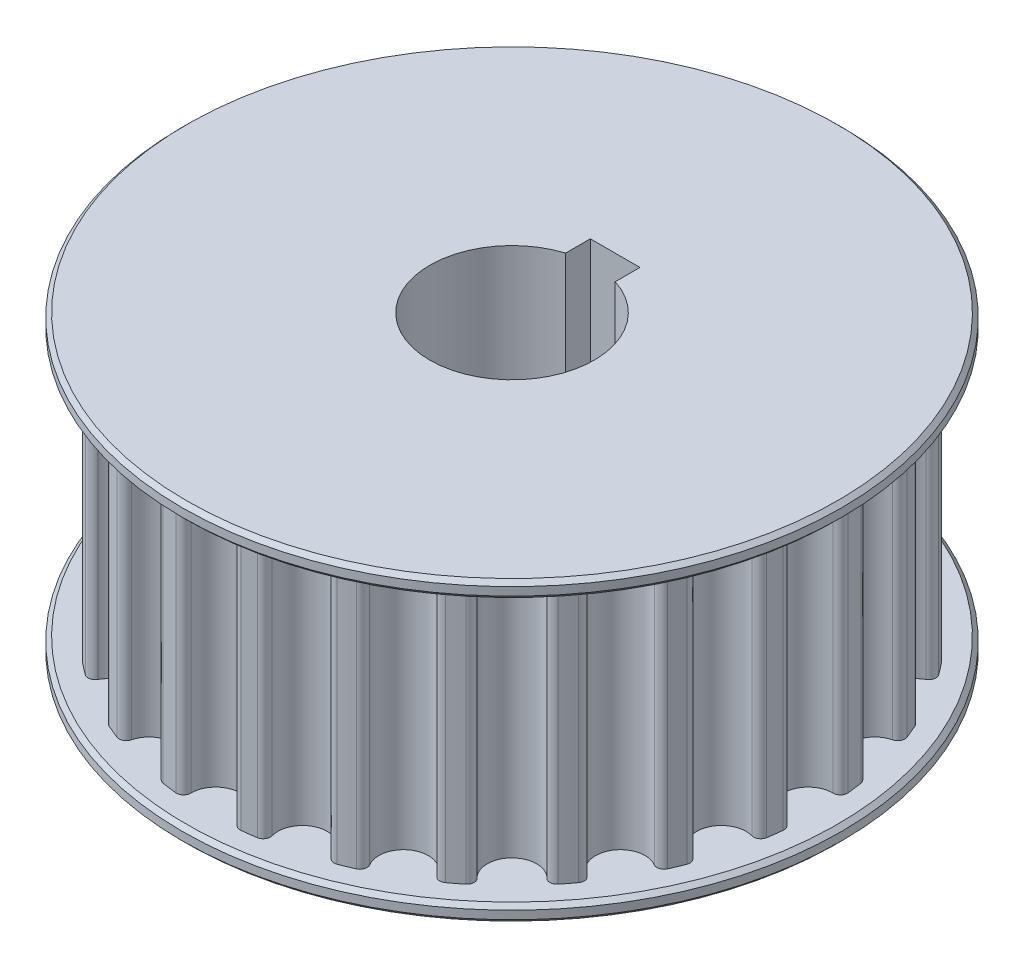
from build123d import *

# Parameters (mm, degrees)
BOSS_EXTRUDE1_DEPTH      = 8
BOSS_EXTRUDE2_START      = 1
SKETCH2_R                = 20
BOSS_EXTRUDE2_DEPTH      = 1
CHAMFER1_SIZE            = 0.25
CHAMFER1_OF_MIRROR1_SIZE = 0.25
SKETCH3_R                = 1.2
CUT_EXTRUDE1_DEPTH       = 30.681644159


with BuildPart() as part:
    # Sketch1 → Boss-Extrude1 (new, symmetric)
    with BuildSketch(Plane(origin=(0, 0, 0), x_dir=(1, 0, 0), z_dir=(0, 1, 0))):
        with BuildLine():
            ThreePointArc((17.76116739, -3.206325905), (18.11028764, -3.154561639), (18.3030647, -2.858924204))
            ThreePointArc((18.3030647, -2.858924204), (18.366516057, -2.417997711), (18.419346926, -1.975673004))
            ThreePointArc((18.419346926, -1.975673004), (18.309655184, -1.640214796), (17.985828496, -1.499855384))
            ThreePointArc((17.985828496, -1.499855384), (16.465, 0), (17.985828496, 1.499855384))
            ThreePointArc((17.985828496, 1.499855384), (18.309655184, 1.640214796), (18.419346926, 1.975673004))
            ThreePointArc((18.419346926, 1.975673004), (18.366516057, 2.417997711), (18.3030647, 2.858924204))
            ThreePointArc((18.3030647, 2.858924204), (18.11028764, 3.154561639), (17.76116739, 3.206325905))
            ThreePointArc((17.76116739, 3.206325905), (15.90396873, 4.261455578), (16.984785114, 6.103824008))
            ThreePointArc((16.984785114, 6.103824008), (17.261249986, 6.323213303), (17.280381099, 6.675631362))
            ThreePointArc((17.280381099, 6.675631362), (17.11486834, 7.089210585), (16.939458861, 7.498690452))
            ThreePointArc((16.939458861, 7.498690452), (16.676733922, 7.734359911), (16.326112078, 7.694001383))
            ThreePointArc((16.326112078, 7.694001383), (14.259108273, 8.2325), (14.826256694, 10.291827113))
            ThreePointArc((14.826256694, 10.291827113), (15.036519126, 10.575295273), (14.963785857, 10.920656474))
            ThreePointArc((14.963785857, 10.920656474), (14.696870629, 11.277305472), (14.421456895, 11.627433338))
            ThreePointArc((14.421456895, 11.627433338), (14.106688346, 11.787074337), (13.778459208, 11.657343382))
            ThreePointArc((13.778459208, 11.657343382), (11.642513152, 11.642513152), (11.657343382, 13.778459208))
            ThreePointArc((11.657343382, 13.778459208), (11.787074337, 14.106688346), (11.627433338, 14.421456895))
            ThreePointArc((11.627433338, 14.421456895), (11.277305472, 14.696870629), (10.920656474, 14.963785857))
            ThreePointArc((10.920656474, 14.963785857), (10.575295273, 15.036519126), (10.291827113, 14.826256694))
            ThreePointArc((10.291827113, 14.826256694), (8.2325, 14.259108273), (7.694001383, 16.326112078))
            ThreePointArc((7.694001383, 16.326112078), (7.734359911, 16.676733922), (7.498690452, 16.939458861))
            ThreePointArc((7.498690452, 16.939458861), (7.089210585, 17.11486834), (6.675631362, 17.280381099))
            ThreePointArc((6.675631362, 17.280381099), (6.323213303, 17.261249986), (6.103824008, 16.984785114))
            ThreePointArc((6.103824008, 16.984785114), (4.261455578, 15.90396873), (3.206325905, 17.76116739))
            ThreePointArc((3.206325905, 17.76116739), (3.154561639, 18.11028764), (2.858924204, 18.3030647))
            ThreePointArc((2.858924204, 18.3030647), (2.417997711, 18.366516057), (1.975673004, 18.419346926))
            ThreePointArc((1.975673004, 18.419346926), (1.640214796, 18.309655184), (1.499855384, 17.985828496))
            ThreePointArc((1.499855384, 17.985828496), (0, 16.465), (-1.499855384, 17.985828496))
            ThreePointArc((-1.499855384, 17.985828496), (-1.640214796, 18.309655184), (-1.975673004, 18.419346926))
            ThreePointArc((-1.975673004, 18.419346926), (-2.417997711, 18.366516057), (-2.858924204, 18.3030647))
            ThreePointArc((-2.858924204, 18.3030647), (-3.154561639, 18.11028764), (-3.206325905, 17.76116739))
            ThreePointArc((-3.206325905, 17.76116739), (-4.261455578, 15.90396873), (-6.103824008, 16.984785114))
            ThreePointArc((-6.103824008, 16.984785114), (-6.323213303, 17.261249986), (-6.675631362, 17.280381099))
            ThreePointArc((-6.675631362, 17.280381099), (-7.089210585, 17.11486834), (-7.498690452, 16.939458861))
            ThreePointArc((-7.498690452, 16.939458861), (-7.734359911, 16.676733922), (-7.694001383, 16.326112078))
            ThreePointArc((-7.694001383, 16.326112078), (-8.2325, 14.259108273), (-10.291827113, 14.826256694))
            ThreePointArc((-10.291827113, 14.826256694), (-10.575295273, 15.036519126), (-10.920656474, 14.963785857))
            ThreePointArc((-10.920656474, 14.963785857), (-11.277305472, 14.696870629), (-11.627433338, 14.421456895))
            ThreePointArc((-11.627433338, 14.421456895), (-11.787074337, 14.106688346), (-11.657343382, 13.778459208))
            ThreePointArc((-11.657343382, 13.778459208), (-11.642513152, 11.642513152), (-13.778459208, 11.657343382))
            ThreePointArc((-13.778459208, 11.657343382), (-14.106688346, 11.787074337), (-14.421456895, 11.627433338))
            ThreePointArc((-14.421456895, 11.627433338), (-14.696870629, 11.277305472), (-14.963785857, 10.920656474))
            ThreePointArc((-14.963785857, 10.920656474), (-15.036519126, 10.575295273), (-14.826256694, 10.291827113))
            ThreePointArc((-14.826256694, 10.291827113), (-14.259108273, 8.2325), (-16.326112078, 7.694001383))
            ThreePointArc((-16.326112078, 7.694001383), (-16.676733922, 7.734359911), (-16.939458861, 7.498690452))
            ThreePointArc((-16.939458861, 7.498690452), (-17.11486834, 7.089210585), (-17.280381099, 6.675631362))
            ThreePointArc((-17.280381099, 6.675631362), (-17.261249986, 6.323213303), (-16.984785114, 6.103824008))
            ThreePointArc((-16.984785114, 6.103824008), (-15.90396873, 4.261455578), (-17.76116739, 3.206325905))
            ThreePointArc((-17.76116739, 3.206325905), (-18.11028764, 3.154561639), (-18.3030647, 2.858924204))
            ThreePointArc((-18.3030647, 2.858924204), (-18.366516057, 2.417997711), (-18.419346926, 1.975673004))
            ThreePointArc((-18.419346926, 1.975673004), (-18.309655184, 1.640214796), (-17.985828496, 1.499855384))
            ThreePointArc((-17.985828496, 1.499855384), (-16.465, 0), (-17.985828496, -1.499855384))
            ThreePointArc((-17.985828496, -1.499855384), (-18.309655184, -1.640214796), (-18.419346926, -1.975673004))
            ThreePointArc((-18.419346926, -1.975673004), (-18.366516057, -2.417997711), (-18.3030647, -2.858924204))
            ThreePointArc((-18.3030647, -2.858924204), (-18.11028764, -3.154561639), (-17.76116739, -3.206325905))
            ThreePointArc((-17.76116739, -3.206325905), (-15.90396873, -4.261455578), (-16.984785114, -6.103824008))
            ThreePointArc((-16.984785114, -6.103824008), (-17.261249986, -6.323213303), (-17.280381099, -6.675631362))
            ThreePointArc((-17.280381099, -6.675631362), (-17.11486834, -7.089210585), (-16.939458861, -7.498690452))
            ThreePointArc((-16.939458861, -7.498690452), (-16.676733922, -7.734359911), (-16.326112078, -7.694001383))
            ThreePointArc((-16.326112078, -7.694001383), (-14.259108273, -8.2325), (-14.826256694, -10.291827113))
            ThreePointArc((-14.826256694, -10.291827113), (-15.036519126, -10.575295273), (-14.963785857, -10.920656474))
            ThreePointArc((-14.963785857, -10.920656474), (-14.696870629, -11.277305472), (-14.421456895, -11.627433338))
            ThreePointArc((-14.421456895, -11.627433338), (-14.106688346, -11.787074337), (-13.778459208, -11.657343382))
            ThreePointArc((-13.778459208, -11.657343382), (-11.642513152, -11.642513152), (-11.657343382, -13.778459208))
            ThreePointArc((-11.657343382, -13.778459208), (-11.787074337, -14.106688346), (-11.627433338, -14.421456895))
            ThreePointArc((-11.627433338, -14.421456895), (-11.277305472, -14.696870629), (-10.920656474, -14.963785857))
            ThreePointArc((-10.920656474, -14.963785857), (-10.575295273, -15.036519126), (-10.291827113, -14.826256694))
            ThreePointArc((-10.291827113, -14.826256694), (-8.2325, -14.259108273), (-7.694001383, -16.326112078))
            ThreePointArc((-7.694001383, -16.326112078), (-7.734359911, -16.676733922), (-7.498690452, -16.939458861))
            ThreePointArc((-7.498690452, -16.939458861), (-7.089210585, -17.11486834), (-6.675631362, -17.280381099))
            ThreePointArc((-6.675631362, -17.280381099), (-6.323213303, -17.261249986), (-6.103824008, -16.984785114))
            ThreePointArc((-6.103824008, -16.984785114), (-4.261455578, -15.90396873), (-3.206325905, -17.76116739))
            ThreePointArc((-3.206325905, -17.76116739), (-3.154561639, -18.11028764), (-2.858924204, -18.3030647))
            ThreePointArc((-2.858924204, -18.3030647), (-2.417997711, -18.366516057), (-1.975673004, -18.419346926))
            ThreePointArc((-1.975673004, -18.419346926), (-1.640214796, -18.309655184), (-1.499855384, -17.985828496))
            ThreePointArc((-1.499855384, -17.985828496), (0, -16.465), (1.499855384, -17.985828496))
            ThreePointArc((1.499855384, -17.985828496), (1.640214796, -18.309655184), (1.975673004, -18.419346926))
            ThreePointArc((1.975673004, -18.419346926), (2.417997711, -18.366516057), (2.858924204, -18.3030647))
            ThreePointArc((2.858924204, -18.3030647), (3.154561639, -18.11028764), (3.206325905, -17.76116739))
            ThreePointArc((3.206325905, -17.76116739), (4.261455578, -15.90396873), (6.103824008, -16.984785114))
            ThreePointArc((6.103824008, -16.984785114), (6.323213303, -17.261249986), (6.675631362, -17.280381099))
            ThreePointArc((6.675631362, -17.280381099), (7.089210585, -17.11486834), (7.498690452, -16.939458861))
            ThreePointArc((7.498690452, -16.939458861), (7.734359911, -16.676733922), (7.694001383, -16.326112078))
            ThreePointArc((7.694001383, -16.326112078), (8.2325, -14.259108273), (10.291827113, -14.826256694))
            ThreePointArc((10.291827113, -14.826256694), (10.575295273, -15.036519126), (10.920656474, -14.963785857))
            ThreePointArc((10.920656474, -14.963785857), (11.277305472, -14.696870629), (11.627433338, -14.421456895))
            ThreePointArc((11.627433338, -14.421456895), (11.787074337, -14.106688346), (11.657343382, -13.778459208))
            ThreePointArc((11.657343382, -13.778459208), (11.642513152, -11.642513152), (13.778459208, -11.657343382))
            ThreePointArc((13.778459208, -11.657343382), (14.106688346, -11.787074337), (14.421456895, -11.627433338))
            ThreePointArc((14.421456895, -11.627433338), (14.696870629, -11.277305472), (14.963785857, -10.920656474))
            ThreePointArc((14.963785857, -10.920656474), (15.036519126, -10.575295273), (14.826256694, -10.291827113))
            ThreePointArc((14.826256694, -10.291827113), (14.259108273, -8.2325), (16.326112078, -7.694001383))
            ThreePointArc((16.326112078, -7.694001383), (16.676733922, -7.734359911), (16.939458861, -7.498690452))
            ThreePointArc((16.939458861, -7.498690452), (17.11486834, -7.089210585), (17.280381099, -6.675631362))
            ThreePointArc((17.280381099, -6.675631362), (17.261249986, -6.323213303), (16.984785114, -6.103824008))
            ThreePointArc((16.984785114, -6.103824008), (15.90396873, -4.261455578), (17.76116739, -3.206325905))
        make_face()
        with BuildLine():
            Line((-1.505, 4.75763334), (-1.505, 6.25763334))
            Line((-1.505, 6.25763334), (1.505, 6.25763334))
            Line((1.505, 6.25763334), (1.505, 4.75763334))
            ThreePointArc((1.505, 4.75763334), (0, -4.99), (-1.505, 4.75763334))
        make_face(mode=Mode.SUBTRACT)
    extrude(amount=BOSS_EXTRUDE1_DEPTH, both=True)

    # Sketch2 → Boss-Extrude2 (add)
    with BuildSketch(Plane(origin=(0, 8, 0), x_dir=(1, 0, 0), z_dir=(0, 1, 0)).offset(BOSS_EXTRUDE2_START)):
        with Locations(Location((0, 0, 0), (0, 0, 270))):
            Circle(SKETCH2_R)
        with BuildLine():
            Line((1.505, 6.25763334), (1.505, 4.75763334))
            ThreePointArc((1.505, 4.75763334), (0, -4.99), (-1.505, 4.75763334))
            Line((-1.505, 4.75763334), (-1.505, 6.25763334))
            Line((-1.505, 6.25763334), (1.505, 6.25763334))
        make_face(mode=Mode.SUBTRACT)
    boss_extrude2 = extrude(amount=-BOSS_EXTRUDE2_DEPTH)

    # Chamfer1
    chamfer1_edges = [part.edges().sort_by_distance(p)[0] for p in [
        (0, 9, -20),
        (0, 8, -20),
    ]]
    chamfer(chamfer1_edges, length=CHAMFER1_SIZE)

    # Mirror1: Boss-Extrude2 across plane
    add(boss_extrude2.mirror(Plane.ZX))

    # Chamfer1 of Mirror1
    chamfer1_of_mirror1_edges = [part.edges().sort_by_distance(p)[0] for p in [
        (0, -9, -20),
        (0, -8, -20),
    ]]
    chamfer(chamfer1_of_mirror1_edges, length=CHAMFER1_OF_MIRROR1_SIZE)

    # Sketch3 → Cut-Extrude1 (cut, through all)
    with BuildSketch(Plane.XY):
        Circle(SKETCH3_R)
    extrude(amount=-CUT_EXTRUDE1_DEPTH, mode=Mode.SUBTRACT)


solid = part.part
